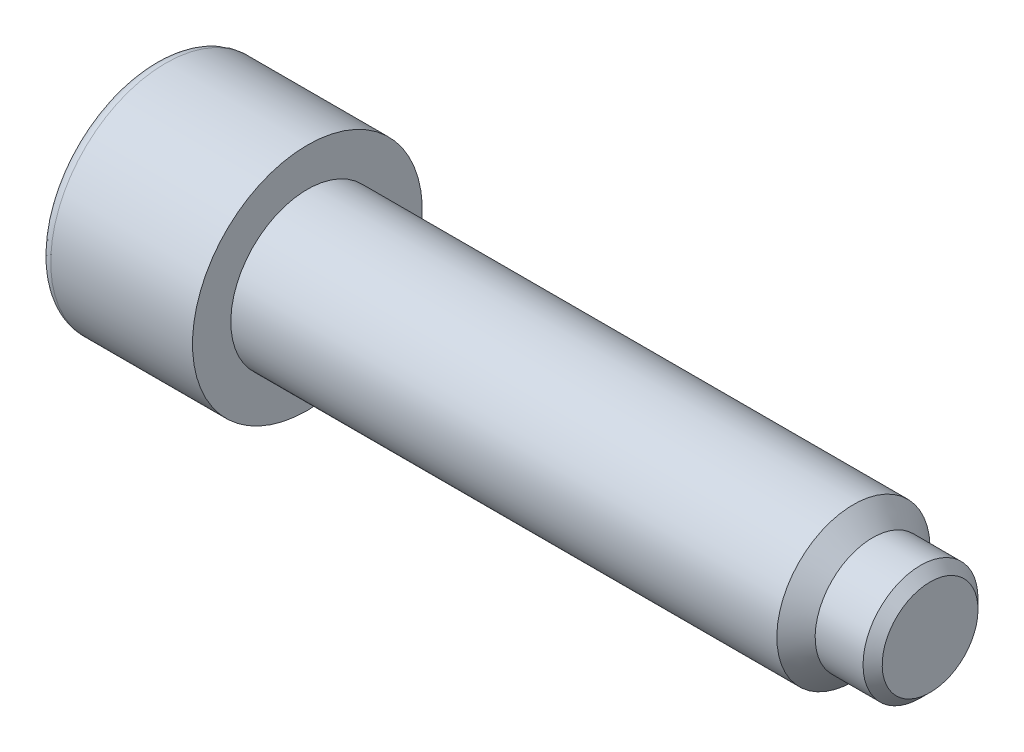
ISO-10303-21;
HEADER;
FILE_DESCRIPTION(('STEP AP214'),'2;1');
FILE_NAME('part.step','',(''),(''),'','','');
FILE_SCHEMA(('AUTOMOTIVE_DESIGN { 1 0 10303 214 1 1 1 1 }'));
ENDSEC;
DATA;
#1=APPLICATION_CONTEXT('core data for automotive mechanical design processes');
#2=APPLICATION_PROTOCOL_DEFINITION('international standard','automotive_design',2000,#1);
#3=PRODUCT_CONTEXT('',#1,'mechanical');
#4=PRODUCT('Part','Part','',(#3));
#5=PRODUCT_RELATED_PRODUCT_CATEGORY('part','',(#4));
#6=PRODUCT_DEFINITION_FORMATION('','',#4);
#7=PRODUCT_DEFINITION_CONTEXT('part definition',#1,'design');
#8=PRODUCT_DEFINITION('design','',#6,#7);
#9=PRODUCT_DEFINITION_SHAPE('','',#8);
#10=(LENGTH_UNIT() NAMED_UNIT(*) SI_UNIT(.MILLI.,.METRE.));
#11=(NAMED_UNIT(*) PLANE_ANGLE_UNIT() SI_UNIT($,.RADIAN.));
#12=(NAMED_UNIT(*) SI_UNIT($,.STERADIAN.) SOLID_ANGLE_UNIT());
#13=UNCERTAINTY_MEASURE_WITH_UNIT(LENGTH_MEASURE(1.E-05),#10,'distance_accuracy_value','');
#14=(GEOMETRIC_REPRESENTATION_CONTEXT(3) GLOBAL_UNCERTAINTY_ASSIGNED_CONTEXT((#13)) GLOBAL_UNIT_ASSIGNED_CONTEXT((#10,
#11,#12)) REPRESENTATION_CONTEXT('',''));
#15=CARTESIAN_POINT('',(0.,0.,0.));
#16=DIRECTION('',(0.,0.,1.));
#17=DIRECTION('',(1.,0.,0.));
#18=AXIS2_PLACEMENT_3D('',#15,#16,#17);
#19=CARTESIAN_POINT('',(9.99999999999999,0.,0.));
#20=DIRECTION('',(-1.,0.,0.));
#21=DIRECTION('',(0.,-1.,0.));
#22=AXIS2_PLACEMENT_3D('',#19,#20,#21);
#23=PLANE('',#22);
#24=CARTESIAN_POINT('',(9.99999999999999,0.,0.));
#25=DIRECTION('',(-1.,0.,0.));
#26=DIRECTION('',(0.,-1.,0.));
#27=AXIS2_PLACEMENT_3D('',#24,#25,#26);
#28=CIRCLE('',#27,10.8);
#29=CARTESIAN_POINT('',(9.99999999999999,-10.8,0.));
#30=VERTEX_POINT('',#29);
#31=EDGE_CURVE('E40',#30,#30,#28,.T.);
#32=ORIENTED_EDGE('',*,*,#31,.T.);
#33=EDGE_LOOP('',(#32));
#34=FACE_BOUND('',#33,.T.);
#35=DIRECTION('',(0.,-1.,0.));
#36=VECTOR('',#35,1.);
#37=CARTESIAN_POINT('',(9.99999999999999,4.04145188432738,-7.));
#38=LINE('',#37,#36);
#39=CARTESIAN_POINT('',(9.99999999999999,4.04145188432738,-7.));
#40=VERTEX_POINT('',#39);
#41=CARTESIAN_POINT('',(9.99999999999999,-4.04145188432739,-7.));
#42=VERTEX_POINT('',#41);
#43=EDGE_CURVE('E47',#40,#42,#38,.T.);
#44=ORIENTED_EDGE('',*,*,#43,.F.);
#45=DIRECTION('',(0.,-0.5,-0.866025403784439));
#46=VECTOR('',#45,1.);
#47=CARTESIAN_POINT('',(9.99999999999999,8.08290376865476,0.));
#48=LINE('',#47,#46);
#49=CARTESIAN_POINT('',(9.99999999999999,8.08290376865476,0.));
#50=VERTEX_POINT('',#49);
#51=EDGE_CURVE('E130',#50,#40,#48,.T.);
#52=ORIENTED_EDGE('',*,*,#51,.F.);
#53=DIRECTION('',(0.,0.499999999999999,-0.866025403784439));
#54=VECTOR('',#53,1.);
#55=CARTESIAN_POINT('',(9.99999999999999,4.04145188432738,7.));
#56=LINE('',#55,#54);
#57=CARTESIAN_POINT('',(9.99999999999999,4.04145188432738,7.));
#58=VERTEX_POINT('',#57);
#59=EDGE_CURVE('E128',#58,#50,#56,.T.);
#60=ORIENTED_EDGE('',*,*,#59,.F.);
#61=DIRECTION('',(0.,1.,0.));
#62=VECTOR('',#61,1.);
#63=CARTESIAN_POINT('',(9.99999999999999,-4.04145188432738,7.));
#64=LINE('',#63,#62);
#65=CARTESIAN_POINT('',(9.99999999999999,-4.04145188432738,7.));
#66=VERTEX_POINT('',#65);
#67=EDGE_CURVE('E95',#66,#58,#64,.T.);
#68=ORIENTED_EDGE('',*,*,#67,.F.);
#69=DIRECTION('',(0.,0.5,0.866025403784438));
#70=VECTOR('',#69,1.);
#71=CARTESIAN_POINT('',(9.99999999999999,-8.08290376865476,0.));
#72=LINE('',#71,#70);
#73=CARTESIAN_POINT('',(9.99999999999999,-8.08290376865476,0.));
#74=VERTEX_POINT('',#73);
#75=EDGE_CURVE('E124',#74,#66,#72,.T.);
#76=ORIENTED_EDGE('',*,*,#75,.F.);
#77=DIRECTION('',(0.,-0.499999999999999,0.866025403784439));
#78=VECTOR('',#77,1.);
#79=CARTESIAN_POINT('',(9.99999999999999,-4.04145188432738,-7.));
#80=LINE('',#79,#78);
#81=EDGE_CURVE('E121',#42,#74,#80,.T.);
#82=ORIENTED_EDGE('',*,*,#81,.F.);
#83=EDGE_LOOP('',(#44,#52,#60,#68,#76,#82));
#84=FACE_BOUND('',#83,.T.);
#85=ADVANCED_FACE('F32',(#34,#84),#23,.T.);
#86=CARTESIAN_POINT('',(91.,0.,0.));
#87=DIRECTION('',(-1.,0.,0.));
#88=DIRECTION('',(0.,-1.,0.));
#89=AXIS2_PLACEMENT_3D('',#86,#87,#88);
#90=CYLINDRICAL_SURFACE('',#89,12.);
#91=CARTESIAN_POINT('',(11.2,0.,0.));
#92=DIRECTION('',(-1.,0.,0.));
#93=DIRECTION('',(0.,-1.,0.));
#94=AXIS2_PLACEMENT_3D('',#91,#92,#93);
#95=CIRCLE('',#94,12.);
#96=CARTESIAN_POINT('',(11.2,-12.,0.));
#97=VERTEX_POINT('',#96);
#98=EDGE_CURVE('E11',#97,#97,#95,.F.);
#99=ORIENTED_EDGE('',*,*,#98,.T.);
#100=EDGE_LOOP('',(#99));
#101=FACE_BOUND('',#100,.T.);
#102=CARTESIAN_POINT('',(26.,0.,0.));
#103=DIRECTION('',(-1.,0.,0.));
#104=DIRECTION('',(0.,-1.,0.));
#105=AXIS2_PLACEMENT_3D('',#102,#103,#104);
#106=CIRCLE('',#105,12.);
#107=CARTESIAN_POINT('',(26.,-12.,0.));
#108=VERTEX_POINT('',#107);
#109=EDGE_CURVE('E148',#108,#108,#106,.T.);
#110=ORIENTED_EDGE('',*,*,#109,.T.);
#111=EDGE_LOOP('',(#110));
#112=FACE_BOUND('',#111,.T.);
#113=ADVANCED_FACE('F170',(#101,#112),#90,.T.);
#114=CARTESIAN_POINT('',(26.,12.,0.));
#115=DIRECTION('',(1.,0.,0.));
#116=DIRECTION('',(0.,1.,0.));
#117=AXIS2_PLACEMENT_3D('',#114,#115,#116);
#118=PLANE('',#117);
#119=CARTESIAN_POINT('',(26.,0.,0.));
#120=DIRECTION('',(-1.,0.,0.));
#121=DIRECTION('',(0.,-1.,0.));
#122=AXIS2_PLACEMENT_3D('',#119,#120,#121);
#123=CIRCLE('',#122,8.);
#124=CARTESIAN_POINT('',(26.,-7.99999999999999,0.));
#125=VERTEX_POINT('',#124);
#126=EDGE_CURVE('E145',#125,#125,#123,.T.);
#127=ORIENTED_EDGE('',*,*,#126,.T.);
#128=EDGE_LOOP('',(#127));
#129=FACE_BOUND('',#128,.T.);
#130=ORIENTED_EDGE('',*,*,#109,.F.);
#131=EDGE_LOOP('',(#130));
#132=FACE_BOUND('',#131,.T.);
#133=ADVANCED_FACE('F175',(#129,#132),#118,.T.);
#134=CARTESIAN_POINT('',(91.,0.,0.));
#135=DIRECTION('',(-1.,0.,0.));
#136=DIRECTION('',(0.,-1.,0.));
#137=AXIS2_PLACEMENT_3D('',#134,#135,#136);
#138=CYLINDRICAL_SURFACE('',#137,8.);
#139=CARTESIAN_POINT('',(83.,0.,0.));
#140=DIRECTION('',(-1.,0.,0.));
#141=DIRECTION('',(0.,-1.,0.));
#142=AXIS2_PLACEMENT_3D('',#139,#140,#141);
#143=CIRCLE('',#142,7.99999999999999);
#144=CARTESIAN_POINT('',(83.,-7.99999999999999,0.));
#145=VERTEX_POINT('',#144);
#146=EDGE_CURVE('E142',#145,#145,#143,.T.);
#147=ORIENTED_EDGE('',*,*,#146,.T.);
#148=EDGE_LOOP('',(#147));
#149=FACE_BOUND('',#148,.T.);
#150=ORIENTED_EDGE('',*,*,#126,.F.);
#151=EDGE_LOOP('',(#150));
#152=FACE_BOUND('',#151,.T.);
#153=ADVANCED_FACE('F181',(#149,#152),#138,.T.);
#154=CARTESIAN_POINT('',(83.,0.,0.));
#155=DIRECTION('',(-1.,0.,0.));
#156=DIRECTION('',(0.,-1.,0.));
#157=AXIS2_PLACEMENT_3D('',#154,#155,#156);
#158=CONICAL_SURFACE('',#157,7.99999999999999,0.78539816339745);
#159=CARTESIAN_POINT('',(85.,0.,0.));
#160=DIRECTION('',(-1.,0.,0.));
#161=DIRECTION('',(0.,-1.,0.));
#162=AXIS2_PLACEMENT_3D('',#159,#160,#161);
#163=CIRCLE('',#162,6.);
#164=CARTESIAN_POINT('',(85.,-5.99999999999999,0.));
#165=VERTEX_POINT('',#164);
#166=EDGE_CURVE('E134',#165,#165,#163,.T.);
#167=ORIENTED_EDGE('',*,*,#166,.T.);
#168=EDGE_LOOP('',(#167));
#169=FACE_BOUND('',#168,.T.);
#170=ORIENTED_EDGE('',*,*,#146,.F.);
#171=EDGE_LOOP('',(#170));
#172=FACE_BOUND('',#171,.T.);
#173=ADVANCED_FACE('F185',(#169,#172),#158,.T.);
#174=CARTESIAN_POINT('',(91.,0.,0.));
#175=DIRECTION('',(-1.,0.,0.));
#176=DIRECTION('',(0.,-1.,0.));
#177=AXIS2_PLACEMENT_3D('',#174,#175,#176);
#178=CYLINDRICAL_SURFACE('',#177,6.);
#179=CARTESIAN_POINT('',(90.,0.,0.));
#180=DIRECTION('',(1.,0.,0.));
#181=DIRECTION('',(0.,1.,0.));
#182=AXIS2_PLACEMENT_3D('',#179,#180,#181);
#183=CIRCLE('',#182,6.);
#184=CARTESIAN_POINT('',(90.,6.00000000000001,0.));
#185=VERTEX_POINT('',#184);
#186=EDGE_CURVE('E151',#185,#185,#183,.F.);
#187=ORIENTED_EDGE('',*,*,#186,.T.);
#188=EDGE_LOOP('',(#187));
#189=FACE_BOUND('',#188,.T.);
#190=ORIENTED_EDGE('',*,*,#166,.F.);
#191=EDGE_LOOP('',(#190));
#192=FACE_BOUND('',#191,.T.);
#193=ADVANCED_FACE('F189',(#189,#192),#178,.T.);
#194=CARTESIAN_POINT('',(91.,6.00000000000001,0.));
#195=DIRECTION('',(1.,0.,0.));
#196=DIRECTION('',(0.,1.,0.));
#197=AXIS2_PLACEMENT_3D('',#194,#195,#196);
#198=PLANE('',#197);
#199=CARTESIAN_POINT('',(91.,0.,0.));
#200=DIRECTION('',(1.,0.,0.));
#201=DIRECTION('',(0.,1.,0.));
#202=AXIS2_PLACEMENT_3D('',#199,#200,#201);
#203=CIRCLE('',#202,5.);
#204=CARTESIAN_POINT('',(91.,5.00000000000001,0.));
#205=VERTEX_POINT('',#204);
#206=EDGE_CURVE('E154',#205,#205,#203,.T.);
#207=ORIENTED_EDGE('',*,*,#206,.T.);
#208=EDGE_LOOP('',(#207));
#209=FACE_BOUND('',#208,.T.);
#210=ADVANCED_FACE('F193',(#209),#198,.T.);
#211=CARTESIAN_POINT('',(18.,4.04145188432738,-7.));
#212=DIRECTION('',(0.,0.,-1.));
#213=DIRECTION('',(-1.,0.,0.));
#214=AXIS2_PLACEMENT_3D('',#211,#212,#213);
#215=PLANE('',#214);
#216=ORIENTED_EDGE('',*,*,#43,.T.);
#217=DIRECTION('',(-1.,0.,0.));
#218=VECTOR('',#217,1.);
#219=CARTESIAN_POINT('',(18.,-4.04145188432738,-7.));
#220=LINE('',#219,#218);
#221=CARTESIAN_POINT('',(18.,-4.04145188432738,-7.));
#222=VERTEX_POINT('',#221);
#223=EDGE_CURVE('E77',#222,#42,#220,.T.);
#224=ORIENTED_EDGE('',*,*,#223,.F.);
#225=DIRECTION('',(0.,-1.,0.));
#226=VECTOR('',#225,1.);
#227=CARTESIAN_POINT('',(18.,4.04145188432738,-7.));
#228=LINE('',#227,#226);
#229=CARTESIAN_POINT('',(18.,4.04145188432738,-7.));
#230=VERTEX_POINT('',#229);
#231=EDGE_CURVE('E132',#230,#222,#228,.T.);
#232=ORIENTED_EDGE('',*,*,#231,.F.);
#233=DIRECTION('',(-1.,0.,0.));
#234=VECTOR('',#233,1.);
#235=CARTESIAN_POINT('',(18.,4.04145188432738,-7.));
#236=LINE('',#235,#234);
#237=EDGE_CURVE('E55',#230,#40,#236,.T.);
#238=ORIENTED_EDGE('',*,*,#237,.T.);
#239=EDGE_LOOP('',(#216,#224,#232,#238));
#240=FACE_BOUND('',#239,.T.);
#241=ADVANCED_FACE('F197',(#240),#215,.F.);
#242=CARTESIAN_POINT('',(18.,8.08290376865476,0.));
#243=DIRECTION('',(0.,0.866025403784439,-0.5));
#244=DIRECTION('',(0.,0.5,0.866025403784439));
#245=AXIS2_PLACEMENT_3D('',#242,#243,#244);
#246=PLANE('',#245);
#247=ORIENTED_EDGE('',*,*,#51,.T.);
#248=ORIENTED_EDGE('',*,*,#237,.F.);
#249=DIRECTION('',(0.,-0.5,-0.866025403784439));
#250=VECTOR('',#249,1.);
#251=CARTESIAN_POINT('',(18.,8.08290376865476,0.));
#252=LINE('',#251,#250);
#253=CARTESIAN_POINT('',(18.,8.08290376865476,0.));
#254=VERTEX_POINT('',#253);
#255=EDGE_CURVE('E107',#254,#230,#252,.T.);
#256=ORIENTED_EDGE('',*,*,#255,.F.);
#257=DIRECTION('',(-1.,0.,0.));
#258=VECTOR('',#257,1.);
#259=CARTESIAN_POINT('',(18.,8.08290376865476,0.));
#260=LINE('',#259,#258);
#261=EDGE_CURVE('E99',#254,#50,#260,.T.);
#262=ORIENTED_EDGE('',*,*,#261,.T.);
#263=EDGE_LOOP('',(#247,#248,#256,#262));
#264=FACE_BOUND('',#263,.T.);
#265=ADVANCED_FACE('F201',(#264),#246,.F.);
#266=CARTESIAN_POINT('',(18.,4.04145188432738,7.));
#267=DIRECTION('',(0.,0.866025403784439,0.5));
#268=DIRECTION('',(0.,-0.499999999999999,0.866025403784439));
#269=AXIS2_PLACEMENT_3D('',#266,#267,#268);
#270=PLANE('',#269);
#271=ORIENTED_EDGE('',*,*,#59,.T.);
#272=ORIENTED_EDGE('',*,*,#261,.F.);
#273=DIRECTION('',(0.,0.499999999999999,-0.866025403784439));
#274=VECTOR('',#273,1.);
#275=CARTESIAN_POINT('',(18.,4.04145188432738,7.));
#276=LINE('',#275,#274);
#277=CARTESIAN_POINT('',(18.,4.04145188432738,7.));
#278=VERTEX_POINT('',#277);
#279=EDGE_CURVE('E103',#278,#254,#276,.T.);
#280=ORIENTED_EDGE('',*,*,#279,.F.);
#281=DIRECTION('',(-1.,0.,0.));
#282=VECTOR('',#281,1.);
#283=CARTESIAN_POINT('',(18.,4.04145188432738,7.));
#284=LINE('',#283,#282);
#285=EDGE_CURVE('E88',#278,#58,#284,.T.);
#286=ORIENTED_EDGE('',*,*,#285,.T.);
#287=EDGE_LOOP('',(#271,#272,#280,#286));
#288=FACE_BOUND('',#287,.T.);
#289=ADVANCED_FACE('F104',(#288),#270,.F.);
#290=CARTESIAN_POINT('',(18.,-4.04145188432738,7.));
#291=DIRECTION('',(0.,0.,1.));
#292=DIRECTION('',(1.,0.,0.));
#293=AXIS2_PLACEMENT_3D('',#290,#291,#292);
#294=PLANE('',#293);
#295=ORIENTED_EDGE('',*,*,#67,.T.);
#296=ORIENTED_EDGE('',*,*,#285,.F.);
#297=DIRECTION('',(0.,1.,0.));
#298=VECTOR('',#297,1.);
#299=CARTESIAN_POINT('',(18.,-4.04145188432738,7.));
#300=LINE('',#299,#298);
#301=CARTESIAN_POINT('',(18.,-4.04145188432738,7.));
#302=VERTEX_POINT('',#301);
#303=EDGE_CURVE('E92',#302,#278,#300,.T.);
#304=ORIENTED_EDGE('',*,*,#303,.F.);
#305=DIRECTION('',(-1.,0.,0.));
#306=VECTOR('',#305,1.);
#307=CARTESIAN_POINT('',(18.,-4.04145188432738,7.));
#308=LINE('',#307,#306);
#309=EDGE_CURVE('E100',#302,#66,#308,.T.);
#310=ORIENTED_EDGE('',*,*,#309,.T.);
#311=EDGE_LOOP('',(#295,#296,#304,#310));
#312=FACE_BOUND('',#311,.T.);
#313=ADVANCED_FACE('F90',(#312),#294,.F.);
#314=CARTESIAN_POINT('',(18.,-8.08290376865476,0.));
#315=DIRECTION('',(0.,-0.866025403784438,0.5));
#316=DIRECTION('',(0.,-0.5,-0.866025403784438));
#317=AXIS2_PLACEMENT_3D('',#314,#315,#316);
#318=PLANE('',#317);
#319=ORIENTED_EDGE('',*,*,#75,.T.);
#320=ORIENTED_EDGE('',*,*,#309,.F.);
#321=DIRECTION('',(0.,0.5,0.866025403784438));
#322=VECTOR('',#321,1.);
#323=CARTESIAN_POINT('',(18.,-8.08290376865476,0.));
#324=LINE('',#323,#322);
#325=CARTESIAN_POINT('',(18.,-8.08290376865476,0.));
#326=VERTEX_POINT('',#325);
#327=EDGE_CURVE('E113',#326,#302,#324,.T.);
#328=ORIENTED_EDGE('',*,*,#327,.F.);
#329=DIRECTION('',(-1.,0.,0.));
#330=VECTOR('',#329,1.);
#331=CARTESIAN_POINT('',(18.,-8.08290376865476,0.));
#332=LINE('',#331,#330);
#333=EDGE_CURVE('E137',#326,#74,#332,.T.);
#334=ORIENTED_EDGE('',*,*,#333,.T.);
#335=EDGE_LOOP('',(#319,#320,#328,#334));
#336=FACE_BOUND('',#335,.T.);
#337=ADVANCED_FACE('F205',(#336),#318,.F.);
#338=CARTESIAN_POINT('',(18.,-4.04145188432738,-7.));
#339=DIRECTION('',(0.,-0.866025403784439,-0.5));
#340=DIRECTION('',(0.,0.499999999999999,-0.866025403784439));
#341=AXIS2_PLACEMENT_3D('',#338,#339,#340);
#342=PLANE('',#341);
#343=ORIENTED_EDGE('',*,*,#81,.T.);
#344=ORIENTED_EDGE('',*,*,#333,.F.);
#345=DIRECTION('',(0.,-0.499999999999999,0.866025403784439));
#346=VECTOR('',#345,1.);
#347=CARTESIAN_POINT('',(18.,-4.04145188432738,-7.));
#348=LINE('',#347,#346);
#349=EDGE_CURVE('E115',#222,#326,#348,.T.);
#350=ORIENTED_EDGE('',*,*,#349,.F.);
#351=ORIENTED_EDGE('',*,*,#223,.T.);
#352=EDGE_LOOP('',(#343,#344,#350,#351));
#353=FACE_BOUND('',#352,.T.);
#354=ADVANCED_FACE('F202',(#353),#342,.F.);
#355=CARTESIAN_POINT('',(18.,-4.04145188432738,-7.));
#356=DIRECTION('',(-1.,0.,0.));
#357=DIRECTION('',(0.,0.,1.));
#358=AXIS2_PLACEMENT_3D('',#355,#356,#357);
#359=PLANE('',#358);
#360=ORIENTED_EDGE('',*,*,#231,.T.);
#361=ORIENTED_EDGE('',*,*,#349,.T.);
#362=ORIENTED_EDGE('',*,*,#327,.T.);
#363=ORIENTED_EDGE('',*,*,#303,.T.);
#364=ORIENTED_EDGE('',*,*,#279,.T.);
#365=ORIENTED_EDGE('',*,*,#255,.T.);
#366=EDGE_LOOP('',(#360,#361,#362,#363,#364,#365));
#367=FACE_BOUND('',#366,.T.);
#368=ADVANCED_FACE('F110',(#367),#359,.T.);
#369=CARTESIAN_POINT('',(90.,0.,0.));
#370=DIRECTION('',(-1.,0.,0.));
#371=DIRECTION('',(0.,-1.,0.));
#372=AXIS2_PLACEMENT_3D('',#369,#370,#371);
#373=CONICAL_SURFACE('',#372,6.,0.785398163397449);
#374=ORIENTED_EDGE('',*,*,#206,.F.);
#375=EDGE_LOOP('',(#374));
#376=FACE_BOUND('',#375,.T.);
#377=ORIENTED_EDGE('',*,*,#186,.F.);
#378=EDGE_LOOP('',(#377));
#379=FACE_BOUND('',#378,.T.);
#380=ADVANCED_FACE('F162',(#376,#379),#373,.T.);
#381=CARTESIAN_POINT('',(11.2,0.,0.));
#382=DIRECTION('',(-1.,0.,0.));
#383=DIRECTION('',(0.,-1.,0.));
#384=AXIS2_PLACEMENT_3D('',#381,#382,#383);
#385=TOROIDAL_SURFACE('',#384,10.8,1.2);
#386=ORIENTED_EDGE('',*,*,#98,.F.);
#387=EDGE_LOOP('',(#386));
#388=FACE_BOUND('',#387,.T.);
#389=ORIENTED_EDGE('',*,*,#31,.F.);
#390=EDGE_LOOP('',(#389));
#391=FACE_BOUND('',#390,.T.);
#392=ADVANCED_FACE('F34',(#388,#391),#385,.T.);
#393=CLOSED_SHELL('',(#85,#113,#133,#153,#173,#193,#210,#241,#265,#289,#313,#337,#354,#368,#380,#392));
#394=MANIFOLD_SOLID_BREP('B2',#393);
#395=ADVANCED_BREP_SHAPE_REPRESENTATION('',(#18,#394),#14);
#396=SHAPE_DEFINITION_REPRESENTATION(#9,#395);
ENDSEC;
END-ISO-10303-21;
